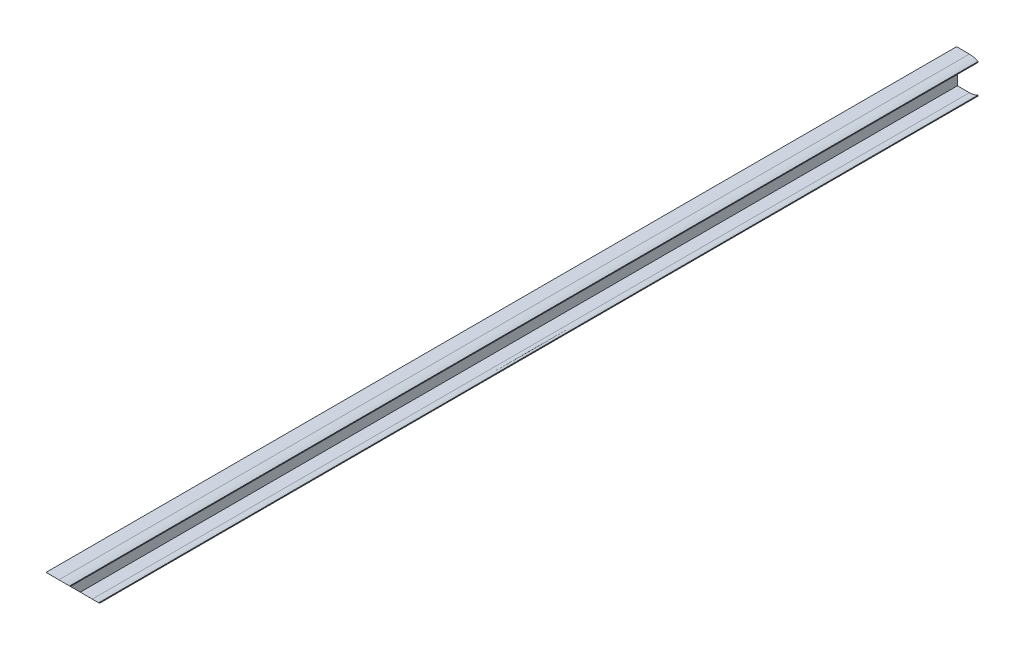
ISO-10303-21;
HEADER;
FILE_DESCRIPTION(('STEP AP214'),'2;1');
FILE_NAME('part.step','',(''),(''),'','','');
FILE_SCHEMA(('AUTOMOTIVE_DESIGN { 1 0 10303 214 1 1 1 1 }'));
ENDSEC;
DATA;
#1=APPLICATION_CONTEXT('core data for automotive mechanical design processes');
#2=APPLICATION_PROTOCOL_DEFINITION('international standard','automotive_design',2000,#1);
#3=PRODUCT_CONTEXT('',#1,'mechanical');
#4=PRODUCT('Part','Part','',(#3));
#5=PRODUCT_RELATED_PRODUCT_CATEGORY('part','',(#4));
#6=PRODUCT_DEFINITION_FORMATION('','',#4);
#7=PRODUCT_DEFINITION_CONTEXT('part definition',#1,'design');
#8=PRODUCT_DEFINITION('design','',#6,#7);
#9=PRODUCT_DEFINITION_SHAPE('','',#8);
#10=(LENGTH_UNIT() NAMED_UNIT(*) SI_UNIT(.MILLI.,.METRE.));
#11=(NAMED_UNIT(*) PLANE_ANGLE_UNIT() SI_UNIT($,.RADIAN.));
#12=(NAMED_UNIT(*) SI_UNIT($,.STERADIAN.) SOLID_ANGLE_UNIT());
#13=UNCERTAINTY_MEASURE_WITH_UNIT(LENGTH_MEASURE(1.E-05),#10,'distance_accuracy_value','');
#14=(GEOMETRIC_REPRESENTATION_CONTEXT(3) GLOBAL_UNCERTAINTY_ASSIGNED_CONTEXT((#13)) GLOBAL_UNIT_ASSIGNED_CONTEXT((#10,
#11,#12)) REPRESENTATION_CONTEXT('',''));
#15=CARTESIAN_POINT('',(0.,0.,0.));
#16=DIRECTION('',(0.,0.,1.));
#17=DIRECTION('',(1.,0.,0.));
#18=AXIS2_PLACEMENT_3D('',#15,#16,#17);
#19=CARTESIAN_POINT('',(0.,0.,2125.));
#20=DIRECTION('',(0.,1.,0.));
#21=DIRECTION('',(0.,0.,1.));
#22=AXIS2_PLACEMENT_3D('',#19,#20,#21);
#23=PLANE('',#22);
#24=DIRECTION('',(0.,0.,-1.));
#25=VECTOR('',#24,1.);
#26=CARTESIAN_POINT('',(30.,0.,2125.));
#27=LINE('',#26,#25);
#28=CARTESIAN_POINT('',(30.0000000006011,0.,2045.));
#29=VERTEX_POINT('',#28);
#30=CARTESIAN_POINT('',(30.,0.,0.));
#31=VERTEX_POINT('',#30);
#32=EDGE_CURVE('E11',#29,#31,#27,.T.);
#33=ORIENTED_EDGE('',*,*,#32,.F.);
#34=DIRECTION('',(-1.,0.,0.));
#35=VECTOR('',#34,1.);
#36=CARTESIAN_POINT('',(50.001,0.,2045.));
#37=LINE('',#36,#35);
#38=CARTESIAN_POINT('',(0.,0.,2045.));
#39=VERTEX_POINT('',#38);
#40=EDGE_CURVE('E168',#29,#39,#37,.T.);
#41=ORIENTED_EDGE('',*,*,#40,.T.);
#42=DIRECTION('',(0.,0.,-1.));
#43=VECTOR('',#42,1.);
#44=CARTESIAN_POINT('',(0.,0.,2125.));
#45=LINE('',#44,#43);
#46=CARTESIAN_POINT('',(0.,0.,0.));
#47=VERTEX_POINT('',#46);
#48=EDGE_CURVE('E116',#39,#47,#45,.T.);
#49=ORIENTED_EDGE('',*,*,#48,.T.);
#50=DIRECTION('',(1.,0.,0.));
#51=VECTOR('',#50,1.);
#52=CARTESIAN_POINT('',(0.,0.,0.));
#53=LINE('',#52,#51);
#54=EDGE_CURVE('E121',#47,#31,#53,.T.);
#55=ORIENTED_EDGE('',*,*,#54,.T.);
#56=EDGE_LOOP('',(#33,#41,#49,#55));
#57=FACE_BOUND('',#56,.T.);
#58=ADVANCED_FACE('F32',(#57),#23,.F.);
#59=CARTESIAN_POINT('',(30.,0.,2125.));
#60=CARTESIAN_POINT('',(40.6032812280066,0.0484567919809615,2125.));
#61=CARTESIAN_POINT('',(50.,5.,2125.));
#62=B_SPLINE_CURVE_WITH_KNOTS('',2,(#59,#60,#61),.UNSPECIFIED.,.F.,.F.,(3,3),(0.,1.),.UNSPECIFIED.);
#63=DIRECTION('',(0.,0.,-1.));
#64=VECTOR('',#63,1.);
#65=SURFACE_OF_LINEAR_EXTRUSION('',#62,#64);
#66=DIRECTION('',(0.,0.,-1.));
#67=VECTOR('',#66,1.);
#68=CARTESIAN_POINT('',(50.,5.,2125.));
#69=LINE('',#68,#67);
#70=CARTESIAN_POINT('',(50.,5.,2050.));
#71=VERTEX_POINT('',#70);
#72=CARTESIAN_POINT('',(50.,5.,0.));
#73=VERTEX_POINT('',#72);
#74=EDGE_CURVE('E46',#71,#73,#69,.T.);
#75=ORIENTED_EDGE('',*,*,#74,.F.);
#76=CARTESIAN_POINT('',(30.0000000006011,1.36626125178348E-12,2045.));
#77=CARTESIAN_POINT('',(30.2965221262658,0.00135208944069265,2045.00135208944));
#78=CARTESIAN_POINT('',(30.5930205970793,0.00558904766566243,2045.00558904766));
#79=CARTESIAN_POINT('',(31.1856963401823,0.0198889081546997,2045.01988890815));
#80=CARTESIAN_POINT('',(31.4818736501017,0.0299510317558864,2045.02995103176));
#81=CARTESIAN_POINT('',(32.073688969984,0.0559567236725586,2045.05595672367));
#82=CARTESIAN_POINT('',(32.3693270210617,0.0718998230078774,2045.07189982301));
#83=CARTESIAN_POINT('',(32.9597359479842,0.109694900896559,2045.1096949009));
#84=CARTESIAN_POINT('',(33.2545071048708,0.131544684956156,2045.13154468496));
#85=CARTESIAN_POINT('',(33.8430758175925,0.181175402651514,2045.18117540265));
#86=CARTESIAN_POINT('',(34.1368732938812,0.208956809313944,2045.20895680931));
#87=CARTESIAN_POINT('',(34.7232698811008,0.270449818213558,2045.27044981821));
#88=CARTESIAN_POINT('',(35.0158687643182,0.304162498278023,2045.30416249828));
#89=CARTESIAN_POINT('',(35.8889009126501,0.413848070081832,2045.41384807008));
#90=CARTESIAN_POINT('',(36.4671828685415,0.498588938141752,2045.49858893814));
#91=CARTESIAN_POINT('',(37.6162181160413,0.69114757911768,2045.69114757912));
#92=CARTESIAN_POINT('',(38.1869682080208,0.798974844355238,2045.79897484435));
#93=CARTESIAN_POINT('',(39.3191210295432,1.03701619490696,2046.03701619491));
#94=CARTESIAN_POINT('',(39.8805226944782,1.16723281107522,2046.16723281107));
#95=CARTESIAN_POINT('',(40.993487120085,1.44938335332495,2046.44938335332));
#96=CARTESIAN_POINT('',(41.5450291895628,1.60135802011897,2046.60135802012));
#97=CARTESIAN_POINT('',(42.6358830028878,1.92568946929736,2046.9256894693));
#98=CARTESIAN_POINT('',(43.1751963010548,2.09804364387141,2047.09804364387));
#99=CARTESIAN_POINT('',(44.2406108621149,2.46185600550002,2047.4618560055));
#100=CARTESIAN_POINT('',(44.7667154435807,2.65330933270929,2047.65330933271));
#101=CARTESIAN_POINT('',(45.560204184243,2.95948974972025,2047.95948974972));
#102=CARTESIAN_POINT('',(45.8325761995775,3.06781364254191,2048.06781364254));
#103=CARTESIAN_POINT('',(46.3733730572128,3.28921123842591,2048.28921123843));
#104=CARTESIAN_POINT('',(46.6417986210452,3.40228405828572,2048.40228405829));
#105=CARTESIAN_POINT('',(47.174672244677,3.63298659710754,2048.63298659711));
#106=CARTESIAN_POINT('',(47.4391205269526,3.75061605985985,2048.75061605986));
#107=CARTESIAN_POINT('',(48.4854647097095,4.22828118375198,2049.22828118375));
#108=CARTESIAN_POINT('',(49.2516390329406,4.60563986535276,2049.60563986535));
#109=CARTESIAN_POINT('',(50.,5.0000000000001,2050.));
#110=B_SPLINE_CURVE_WITH_KNOTS('',3,(#76,#77,#78,#79,#80,#81,#82,#83,#84,#85,#86,#87,#88,#89,
#90,#91,#92,#93,#94,#95,#96,#97,#98,#99,#100,#101,#102,#103,#104,#105,#106,#107,#108,#109),
.UNSPECIFIED.,.F.,.F.,(4,2,2,2,2,2,2,2,2,2,2,2,2,2,2,2,4),(0.,0.889560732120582,
1.77900258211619,2.6683735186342,3.55741448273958,4.44652637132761,5.33579999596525,
7.10646365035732,8.8778567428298,10.6494502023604,12.4244053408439,14.199133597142,
15.9734114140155,16.9108234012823,17.8480618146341,18.7852476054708,21.5842762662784),.UNSPECIFIED.);
#111=EDGE_CURVE('E158',#29,#71,#110,.T.);
#112=ORIENTED_EDGE('',*,*,#111,.F.);
#113=ORIENTED_EDGE('',*,*,#32,.T.);
#114=CARTESIAN_POINT('',(30.,0.,0.));
#115=CARTESIAN_POINT('',(40.6032812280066,0.0484567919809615,0.));
#116=CARTESIAN_POINT('',(50.,5.,0.));
#117=B_SPLINE_CURVE_WITH_KNOTS('',2,(#114,#115,#116),.UNSPECIFIED.,.F.,.F.,(3,3),(0.,1.),.UNSPECIFIED.);
#118=EDGE_CURVE('E307',#31,#73,#117,.T.);
#119=ORIENTED_EDGE('',*,*,#118,.T.);
#120=EDGE_LOOP('',(#75,#112,#113,#119));
#121=FACE_BOUND('',#120,.T.);
#122=ADVANCED_FACE('F243',(#121),#65,.F.);
#123=CARTESIAN_POINT('',(50.,5.,2125.));
#124=DIRECTION('',(-1.,0.,0.));
#125=DIRECTION('',(0.,0.,1.));
#126=AXIS2_PLACEMENT_3D('',#123,#124,#125);
#127=PLANE('',#126);
#128=DIRECTION('',(0.,0.,-1.));
#129=VECTOR('',#128,1.);
#130=CARTESIAN_POINT('',(50.,7.00000000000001,2125.));
#131=LINE('',#130,#129);
#132=CARTESIAN_POINT('',(50.,7.00000000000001,2052.));
#133=VERTEX_POINT('',#132);
#134=CARTESIAN_POINT('',(50.,7.00000000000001,0.));
#135=VERTEX_POINT('',#134);
#136=EDGE_CURVE('E155',#133,#135,#131,.T.);
#137=ORIENTED_EDGE('',*,*,#136,.F.);
#138=DIRECTION('',(0.,0.707106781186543,0.707106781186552));
#139=VECTOR('',#138,1.);
#140=CARTESIAN_POINT('',(50.,80.,2125.));
#141=LINE('',#140,#139);
#142=EDGE_CURVE('E161',#71,#133,#141,.T.);
#143=ORIENTED_EDGE('',*,*,#142,.F.);
#144=ORIENTED_EDGE('',*,*,#74,.T.);
#145=DIRECTION('',(0.,1.,0.));
#146=VECTOR('',#145,1.);
#147=CARTESIAN_POINT('',(50.,5.,0.));
#148=LINE('',#147,#146);
#149=EDGE_CURVE('E311',#73,#135,#148,.T.);
#150=ORIENTED_EDGE('',*,*,#149,.T.);
#151=EDGE_LOOP('',(#137,#143,#144,#150));
#152=FACE_BOUND('',#151,.T.);
#153=ADVANCED_FACE('F246',(#152),#127,.F.);
#154=CARTESIAN_POINT('',(50.,7.00000000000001,2125.));
#155=CARTESIAN_POINT('',(40.6032812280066,2.04845679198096,2125.));
#156=CARTESIAN_POINT('',(30.,2.,2125.));
#157=B_SPLINE_CURVE_WITH_KNOTS('',2,(#154,#155,#156),.UNSPECIFIED.,.F.,.F.,(3,3),(0.,1.),.UNSPECIFIED.);
#158=DIRECTION('',(0.,0.,-1.));
#159=VECTOR('',#158,1.);
#160=SURFACE_OF_LINEAR_EXTRUSION('',#157,#159);
#161=DIRECTION('',(0.,0.,-1.));
#162=VECTOR('',#161,1.);
#163=CARTESIAN_POINT('',(30.,2.,2125.));
#164=LINE('',#163,#162);
#165=CARTESIAN_POINT('',(30.,2.,2047.));
#166=VERTEX_POINT('',#165);
#167=CARTESIAN_POINT('',(30.,2.,0.));
#168=VERTEX_POINT('',#167);
#169=EDGE_CURVE('E144',#166,#168,#164,.T.);
#170=ORIENTED_EDGE('',*,*,#169,.F.);
#171=CARTESIAN_POINT('',(50.,7.00000000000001,2052.));
#172=CARTESIAN_POINT('',(49.521055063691,6.74761460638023,2051.74761460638));
#173=CARTESIAN_POINT('',(49.0347280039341,6.50214773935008,2051.50214773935));
#174=CARTESIAN_POINT('',(48.0467010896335,6.02606279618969,2051.02606279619));
#175=CARTESIAN_POINT('',(47.544979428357,5.79546736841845,2050.79546736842));
#176=CARTESIAN_POINT('',(46.5267291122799,5.35078644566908,2050.35078644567));
#177=CARTESIAN_POINT('',(46.0101932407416,5.13670919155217,2050.13670919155));
#178=CARTESIAN_POINT('',(44.9634416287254,4.72679072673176,2049.72679072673));
#179=CARTESIAN_POINT('',(44.4332389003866,4.53093293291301,2049.53093293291));
#180=CARTESIAN_POINT('',(43.3596325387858,4.15871016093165,2049.15871016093));
#181=CARTESIAN_POINT('',(42.8162357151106,3.98233537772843,2048.98233537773));
#182=CARTESIAN_POINT('',(41.7171702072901,3.65035131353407,2048.65035131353));
#183=CARTESIAN_POINT('',(41.1615076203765,3.49473197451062,2048.49473197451));
#184=CARTESIAN_POINT('',(40.1825845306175,3.24237137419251,2048.24237137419));
#185=CARTESIAN_POINT('',(39.7618260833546,3.14075340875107,2048.14075340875));
#186=CARTESIAN_POINT('',(38.9146879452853,2.95002496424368,2047.95002496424));
#187=CARTESIAN_POINT('',(38.4883085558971,2.86091381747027,2047.86091381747));
#188=CARTESIAN_POINT('',(37.6310401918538,2.69562554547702,2047.69562554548));
#189=CARTESIAN_POINT('',(37.2001563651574,2.61943507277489,2047.61943507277));
#190=CARTESIAN_POINT('',(36.3341748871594,2.48013219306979,2047.48013219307));
#191=CARTESIAN_POINT('',(35.8990771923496,2.41701992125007,2047.41701992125));
#192=CARTESIAN_POINT('',(35.0123765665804,2.30235066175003,2047.30235066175));
#193=CARTESIAN_POINT('',(34.5606694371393,2.25119612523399,2047.25119612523));
#194=CARTESIAN_POINT('',(33.6544975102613,2.16301119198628,2047.16301119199));
#195=CARTESIAN_POINT('',(33.2000326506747,2.12598111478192,2047.12598111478));
#196=CARTESIAN_POINT('',(32.2884626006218,2.0659644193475,2047.06596441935));
#197=CARTESIAN_POINT('',(31.831354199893,2.04300224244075,2047.04300224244));
#198=CARTESIAN_POINT('',(30.9161801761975,2.01105819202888,2047.01105819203));
#199=CARTESIAN_POINT('',(30.4581145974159,2.00207568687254,2047.00207568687));
#200=CARTESIAN_POINT('',(30.,1.99999999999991,2047.));
#201=B_SPLINE_CURVE_WITH_KNOTS('',3,(#171,#172,#173,#174,#175,#176,#177,#178,#179,#180,#181,
#182,#183,#184,#185,#186,#187,#188,#189,#190,#191,#192,#193,#194,#195,#196,#197,#198,#199,#200),
.UNSPECIFIED.,.F.,.F.,(4,2,2,2,2,2,2,2,2,2,2,2,2,2,4),(0.,1.79192712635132,3.58652177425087,
5.38200602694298,7.17583972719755,8.96876650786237,10.760821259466,12.0943329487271,
13.4277734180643,14.7598278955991,16.0918961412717,17.463838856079,18.8358126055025,
20.2101632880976,21.5844518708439),.UNSPECIFIED.);
#202=EDGE_CURVE('E380',#133,#166,#201,.T.);
#203=ORIENTED_EDGE('',*,*,#202,.F.);
#204=ORIENTED_EDGE('',*,*,#136,.T.);
#205=CARTESIAN_POINT('',(50.,7.00000000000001,0.));
#206=CARTESIAN_POINT('',(40.6032812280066,2.04845679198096,0.));
#207=CARTESIAN_POINT('',(30.,2.,0.));
#208=B_SPLINE_CURVE_WITH_KNOTS('',2,(#205,#206,#207),.UNSPECIFIED.,.F.,.F.,(3,3),(0.,1.),.UNSPECIFIED.);
#209=EDGE_CURVE('E313',#135,#168,#208,.T.);
#210=ORIENTED_EDGE('',*,*,#209,.T.);
#211=EDGE_LOOP('',(#170,#203,#204,#210));
#212=FACE_BOUND('',#211,.T.);
#213=ADVANCED_FACE('F250',(#212),#160,.F.);
#214=CARTESIAN_POINT('',(2.,2.,2125.));
#215=DIRECTION('',(0.,-1.,0.));
#216=DIRECTION('',(0.,0.,-1.));
#217=AXIS2_PLACEMENT_3D('',#214,#215,#216);
#218=PLANE('',#217);
#219=DIRECTION('',(0.,0.,-1.));
#220=VECTOR('',#219,1.);
#221=CARTESIAN_POINT('',(2.,2.,2125.));
#222=LINE('',#221,#220);
#223=CARTESIAN_POINT('',(2.,2.,2047.));
#224=VERTEX_POINT('',#223);
#225=CARTESIAN_POINT('',(2.,2.,0.));
#226=VERTEX_POINT('',#225);
#227=EDGE_CURVE('E150',#224,#226,#222,.T.);
#228=ORIENTED_EDGE('',*,*,#227,.F.);
#229=DIRECTION('',(-1.,0.,0.));
#230=VECTOR('',#229,1.);
#231=CARTESIAN_POINT('',(50.001,2.,2047.));
#232=LINE('',#231,#230);
#233=EDGE_CURVE('E231',#166,#224,#232,.T.);
#234=ORIENTED_EDGE('',*,*,#233,.F.);
#235=ORIENTED_EDGE('',*,*,#169,.T.);
#236=DIRECTION('',(-1.,0.,0.));
#237=VECTOR('',#236,1.);
#238=CARTESIAN_POINT('',(2.,2.,0.));
#239=LINE('',#238,#237);
#240=EDGE_CURVE('E325',#168,#226,#239,.T.);
#241=ORIENTED_EDGE('',*,*,#240,.T.);
#242=EDGE_LOOP('',(#228,#234,#235,#241));
#243=FACE_BOUND('',#242,.T.);
#244=ADVANCED_FACE('F254',(#243),#218,.F.);
#245=CARTESIAN_POINT('',(2.,78.,2125.));
#246=DIRECTION('',(-1.,0.,0.));
#247=DIRECTION('',(0.,0.,1.));
#248=AXIS2_PLACEMENT_3D('',#245,#246,#247);
#249=PLANE('',#248);
#250=DIRECTION('',(0.,0.,-1.));
#251=VECTOR('',#250,1.);
#252=CARTESIAN_POINT('',(2.,78.,2125.));
#253=LINE('',#252,#251);
#254=CARTESIAN_POINT('',(2.,78.,2123.));
#255=VERTEX_POINT('',#254);
#256=CARTESIAN_POINT('',(2.,78.,0.));
#257=VERTEX_POINT('',#256);
#258=EDGE_CURVE('E143',#255,#257,#253,.T.);
#259=ORIENTED_EDGE('',*,*,#258,.F.);
#260=DIRECTION('',(0.,0.707106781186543,0.707106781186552));
#261=VECTOR('',#260,1.);
#262=CARTESIAN_POINT('',(2.,80.,2125.));
#263=LINE('',#262,#261);
#264=EDGE_CURVE('E217',#224,#255,#263,.T.);
#265=ORIENTED_EDGE('',*,*,#264,.F.);
#266=ORIENTED_EDGE('',*,*,#227,.T.);
#267=DIRECTION('',(0.,1.,0.));
#268=VECTOR('',#267,1.);
#269=CARTESIAN_POINT('',(2.,78.,0.));
#270=LINE('',#269,#268);
#271=EDGE_CURVE('E331',#226,#257,#270,.T.);
#272=ORIENTED_EDGE('',*,*,#271,.T.);
#273=EDGE_LOOP('',(#259,#265,#266,#272));
#274=FACE_BOUND('',#273,.T.);
#275=ADVANCED_FACE('F258',(#274),#249,.F.);
#276=CARTESIAN_POINT('',(2.,78.,2125.));
#277=DIRECTION('',(0.,1.,0.));
#278=DIRECTION('',(0.,0.,1.));
#279=AXIS2_PLACEMENT_3D('',#276,#277,#278);
#280=PLANE('',#279);
#281=DIRECTION('',(0.,0.,-1.));
#282=VECTOR('',#281,1.);
#283=CARTESIAN_POINT('',(30.,78.,2125.));
#284=LINE('',#283,#282);
#285=CARTESIAN_POINT('',(30.,78.,2123.));
#286=VERTEX_POINT('',#285);
#287=CARTESIAN_POINT('',(30.,78.,0.));
#288=VERTEX_POINT('',#287);
#289=EDGE_CURVE('E141',#286,#288,#284,.T.);
#290=ORIENTED_EDGE('',*,*,#289,.F.);
#291=DIRECTION('',(1.,0.,0.));
#292=VECTOR('',#291,1.);
#293=CARTESIAN_POINT('',(50.001,78.,2123.));
#294=LINE('',#293,#292);
#295=EDGE_CURVE('E214',#255,#286,#294,.T.);
#296=ORIENTED_EDGE('',*,*,#295,.F.);
#297=ORIENTED_EDGE('',*,*,#258,.T.);
#298=DIRECTION('',(1.,0.,0.));
#299=VECTOR('',#298,1.);
#300=CARTESIAN_POINT('',(2.,78.,0.));
#301=LINE('',#300,#299);
#302=EDGE_CURVE('E334',#257,#288,#301,.T.);
#303=ORIENTED_EDGE('',*,*,#302,.T.);
#304=EDGE_LOOP('',(#290,#296,#297,#303));
#305=FACE_BOUND('',#304,.T.);
#306=ADVANCED_FACE('F262',(#305),#280,.F.);
#307=CARTESIAN_POINT('',(30.,78.,2125.));
#308=CARTESIAN_POINT('',(40.6032812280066,77.951543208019,2125.));
#309=CARTESIAN_POINT('',(50.,73.,2125.));
#310=B_SPLINE_CURVE_WITH_KNOTS('',2,(#307,#308,#309),.UNSPECIFIED.,.F.,.F.,(3,3),(0.,1.),.UNSPECIFIED.);
#311=DIRECTION('',(0.,0.,-1.));
#312=VECTOR('',#311,1.);
#313=SURFACE_OF_LINEAR_EXTRUSION('',#310,#312);
#314=DIRECTION('',(0.,0.,-1.));
#315=VECTOR('',#314,1.);
#316=CARTESIAN_POINT('',(50.,73.,2125.));
#317=LINE('',#316,#315);
#318=CARTESIAN_POINT('',(50.,73.,2118.));
#319=VERTEX_POINT('',#318);
#320=CARTESIAN_POINT('',(50.,73.,0.));
#321=VERTEX_POINT('',#320);
#322=EDGE_CURVE('E137',#319,#321,#317,.T.);
#323=ORIENTED_EDGE('',*,*,#322,.F.);
#324=CARTESIAN_POINT('',(30.,78.,2123.));
#325=CARTESIAN_POINT('',(30.2965221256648,77.9986479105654,2122.99864791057));
#326=CARTESIAN_POINT('',(30.5930205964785,77.9944109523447,2122.99441095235));
#327=CARTESIAN_POINT('',(31.1856963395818,77.9801110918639,2122.98011109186));
#328=CARTESIAN_POINT('',(31.4818736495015,77.9700489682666,2122.97004896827));
#329=CARTESIAN_POINT('',(32.0736889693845,77.9440432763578,2122.94404327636));
#330=CARTESIAN_POINT('',(32.3693270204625,77.9281001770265,2122.92810017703));
#331=CARTESIAN_POINT('',(32.959735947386,77.8903050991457,2122.89030509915));
#332=CARTESIAN_POINT('',(33.2545071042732,77.8684553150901,2122.86845531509));
#333=CARTESIAN_POINT('',(33.8430758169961,77.8188245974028,2122.8188245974));
#334=CARTESIAN_POINT('',(34.1368732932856,77.7910431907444,2122.79104319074));
#335=CARTESIAN_POINT('',(34.7232698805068,77.7295501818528,2122.72955018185));
#336=CARTESIAN_POINT('',(35.0158687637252,77.6958375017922,2122.69583750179));
#337=CARTESIAN_POINT('',(35.8889009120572,77.5861519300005,2122.58615193));
#338=CARTESIAN_POINT('',(36.467182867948,77.5014110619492,2122.50141106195));
#339=CARTESIAN_POINT('',(37.6162181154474,77.3088524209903,2122.30885242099));
#340=CARTESIAN_POINT('',(38.186968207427,77.2010251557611,2122.20102515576));
#341=CARTESIAN_POINT('',(39.3191210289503,76.9629838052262,2121.96298380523));
#342=CARTESIAN_POINT('',(39.8805226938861,76.8327671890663,2121.83276718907));
#343=CARTESIAN_POINT('',(40.9934871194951,76.5506166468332,2121.55061664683));
#344=CARTESIAN_POINT('',(41.5450291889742,76.3986419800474,2121.39864198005));
#345=CARTESIAN_POINT('',(42.6358830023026,76.0743105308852,2121.07431053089));
#346=CARTESIAN_POINT('',(43.1751963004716,75.9019563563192,2120.90195635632));
#347=CARTESIAN_POINT('',(44.2406108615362,75.5381439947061,2120.53814399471));
#348=CARTESIAN_POINT('',(44.7667154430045,75.3466906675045,2120.3466906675));
#349=CARTESIAN_POINT('',(45.5602041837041,75.0405102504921,2120.04051025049));
#350=CARTESIAN_POINT('',(45.8325761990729,74.932186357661,2119.93218635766));
#351=CARTESIAN_POINT('',(46.3733730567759,74.7107887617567,2119.71078876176));
#352=CARTESIAN_POINT('',(46.6417986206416,74.5977159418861,2119.59771594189));
#353=CARTESIAN_POINT('',(47.1746722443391,74.3670134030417,2119.36701340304));
#354=CARTESIAN_POINT('',(47.4391205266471,74.2493839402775,2119.24938394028));
#355=CARTESIAN_POINT('',(48.4854647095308,73.771718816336,2118.77171881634));
#356=CARTESIAN_POINT('',(49.2516390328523,73.3943601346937,2118.39436013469));
#357=CARTESIAN_POINT('',(50.,73.,2118.));
#358=B_SPLINE_CURVE_WITH_KNOTS('',3,(#324,#325,#326,#327,#328,#329,#330,#331,#332,#333,#334,
#335,#336,#337,#338,#339,#340,#341,#342,#343,#344,#345,#346,#347,#348,#349,#350,#351,#352,#353,
#354,#355,#356,#357),.UNSPECIFIED.,.F.,.F.,(4,2,2,2,2,2,2,2,2,2,2,2,2,2,2,2,4),(0.,
0.889560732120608,1.77900258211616,2.66837351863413,3.55741448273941,4.44652637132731,
5.33579999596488,7.10646365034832,8.87785674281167,10.6494502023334,12.4244053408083,
14.1991335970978,15.9734114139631,16.9108234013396,17.8480618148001,18.7852476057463,
21.5842762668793),.UNSPECIFIED.);
#359=EDGE_CURVE('E212',#286,#319,#358,.T.);
#360=ORIENTED_EDGE('',*,*,#359,.F.);
#361=ORIENTED_EDGE('',*,*,#289,.T.);
#362=CARTESIAN_POINT('',(30.,78.,0.));
#363=CARTESIAN_POINT('',(40.6032812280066,77.951543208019,0.));
#364=CARTESIAN_POINT('',(50.,73.,0.));
#365=B_SPLINE_CURVE_WITH_KNOTS('',2,(#362,#363,#364),.UNSPECIFIED.,.F.,.F.,(3,3),(0.,1.),.UNSPECIFIED.);
#366=EDGE_CURVE('E337',#288,#321,#365,.T.);
#367=ORIENTED_EDGE('',*,*,#366,.T.);
#368=EDGE_LOOP('',(#323,#360,#361,#367));
#369=FACE_BOUND('',#368,.T.);
#370=ADVANCED_FACE('F266',(#369),#313,.F.);
#371=CARTESIAN_POINT('',(50.,75.,2125.));
#372=DIRECTION('',(-1.,0.,0.));
#373=DIRECTION('',(0.,0.,1.));
#374=AXIS2_PLACEMENT_3D('',#371,#372,#373);
#375=PLANE('',#374);
#376=DIRECTION('',(0.,0.,-1.));
#377=VECTOR('',#376,1.);
#378=CARTESIAN_POINT('',(50.,75.,2125.));
#379=LINE('',#378,#377);
#380=CARTESIAN_POINT('',(50.,75.,2120.));
#381=VERTEX_POINT('',#380);
#382=CARTESIAN_POINT('',(50.,75.,0.));
#383=VERTEX_POINT('',#382);
#384=EDGE_CURVE('E129',#381,#383,#379,.T.);
#385=ORIENTED_EDGE('',*,*,#384,.F.);
#386=DIRECTION('',(0.,0.707106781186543,0.707106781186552));
#387=VECTOR('',#386,1.);
#388=CARTESIAN_POINT('',(50.,80.,2125.));
#389=LINE('',#388,#387);
#390=EDGE_CURVE('E220',#319,#381,#389,.T.);
#391=ORIENTED_EDGE('',*,*,#390,.F.);
#392=ORIENTED_EDGE('',*,*,#322,.T.);
#393=DIRECTION('',(0.,1.,0.));
#394=VECTOR('',#393,1.);
#395=CARTESIAN_POINT('',(50.,75.,0.));
#396=LINE('',#395,#394);
#397=EDGE_CURVE('E342',#321,#383,#396,.T.);
#398=ORIENTED_EDGE('',*,*,#397,.T.);
#399=EDGE_LOOP('',(#385,#391,#392,#398));
#400=FACE_BOUND('',#399,.T.);
#401=ADVANCED_FACE('F270',(#400),#375,.F.);
#402=CARTESIAN_POINT('',(50.,75.,2125.));
#403=CARTESIAN_POINT('',(40.6032812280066,79.951543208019,2125.));
#404=CARTESIAN_POINT('',(30.,80.,2125.));
#405=B_SPLINE_CURVE_WITH_KNOTS('',2,(#402,#403,#404),.UNSPECIFIED.,.F.,.F.,(3,3),(0.,1.),.UNSPECIFIED.);
#406=DIRECTION('',(0.,0.,-1.));
#407=VECTOR('',#406,1.);
#408=SURFACE_OF_LINEAR_EXTRUSION('',#405,#407);
#409=DIRECTION('',(0.,0.,-1.));
#410=VECTOR('',#409,1.);
#411=CARTESIAN_POINT('',(30.,80.,2125.));
#412=LINE('',#411,#410);
#413=CARTESIAN_POINT('',(30.,80.,2125.));
#414=VERTEX_POINT('',#413);
#415=CARTESIAN_POINT('',(30.,80.,0.));
#416=VERTEX_POINT('',#415);
#417=EDGE_CURVE('E101',#414,#416,#412,.T.);
#418=ORIENTED_EDGE('',*,*,#417,.F.);
#419=CARTESIAN_POINT('',(50.,75.,2120.));
#420=CARTESIAN_POINT('',(49.5210550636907,75.2523853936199,2120.25238539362));
#421=CARTESIAN_POINT('',(49.0347280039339,75.49785226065,2120.49785226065));
#422=CARTESIAN_POINT('',(48.0467010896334,75.9739372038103,2120.97393720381));
#423=CARTESIAN_POINT('',(47.5449794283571,76.2045326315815,2121.20453263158));
#424=CARTESIAN_POINT('',(46.5267291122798,76.6492135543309,2121.64921355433));
#425=CARTESIAN_POINT('',(46.0101932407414,76.8632908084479,2121.86329080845));
#426=CARTESIAN_POINT('',(44.9634416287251,77.2732092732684,2122.27320927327));
#427=CARTESIAN_POINT('',(44.4332389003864,77.4690670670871,2122.46906706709));
#428=CARTESIAN_POINT('',(43.3596325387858,77.8412898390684,2122.84128983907));
#429=CARTESIAN_POINT('',(42.8162357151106,78.0176646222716,2123.01766462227));
#430=CARTESIAN_POINT('',(41.71717020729,78.3496486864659,2123.34964868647));
#431=CARTESIAN_POINT('',(41.1615076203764,78.5052680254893,2123.50526802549));
#432=CARTESIAN_POINT('',(40.1825845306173,78.7576286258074,2123.75762862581));
#433=CARTESIAN_POINT('',(39.7618260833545,78.8592465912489,2123.85924659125));
#434=CARTESIAN_POINT('',(38.9146879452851,79.0499750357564,2124.04997503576));
#435=CARTESIAN_POINT('',(38.488308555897,79.1390861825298,2124.13908618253));
#436=CARTESIAN_POINT('',(37.6310401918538,79.304374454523,2124.30437445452));
#437=CARTESIAN_POINT('',(37.2001563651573,79.3805649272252,2124.38056492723));
#438=CARTESIAN_POINT('',(36.3341748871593,79.5198678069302,2124.51986780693));
#439=CARTESIAN_POINT('',(35.8990771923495,79.5829800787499,2124.58298007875));
#440=CARTESIAN_POINT('',(35.0123765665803,79.6976493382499,2124.69764933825));
#441=CARTESIAN_POINT('',(34.5606694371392,79.748803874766,2124.74880387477));
#442=CARTESIAN_POINT('',(33.6544975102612,79.8369888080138,2124.83698880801));
#443=CARTESIAN_POINT('',(33.2000326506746,79.8740188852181,2124.87401888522));
#444=CARTESIAN_POINT('',(32.2884626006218,79.9340355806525,2124.93403558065));
#445=CARTESIAN_POINT('',(31.831354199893,79.9569977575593,2124.95699775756));
#446=CARTESIAN_POINT('',(30.9161801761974,79.9889418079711,2124.98894180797));
#447=CARTESIAN_POINT('',(30.4581145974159,79.9979243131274,2124.99792431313));
#448=CARTESIAN_POINT('',(30.,80.,2125.));
#449=B_SPLINE_CURVE_WITH_KNOTS('',3,(#419,#420,#421,#422,#423,#424,#425,#426,#427,#428,#429,
#430,#431,#432,#433,#434,#435,#436,#437,#438,#439,#440,#441,#442,#443,#444,#445,#446,#447,#448),
.UNSPECIFIED.,.F.,.F.,(4,2,2,2,2,2,2,2,2,2,2,2,2,2,4),(0.,1.79192712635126,3.58652177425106,
5.38200602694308,7.17583972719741,8.96876650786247,10.760821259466,12.0943329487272,
13.4277734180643,14.7598278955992,16.0918961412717,17.463838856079,18.8358126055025,
20.2101632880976,21.5844518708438),.UNSPECIFIED.);
#450=EDGE_CURVE('E54',#381,#414,#449,.T.);
#451=ORIENTED_EDGE('',*,*,#450,.F.);
#452=ORIENTED_EDGE('',*,*,#384,.T.);
#453=CARTESIAN_POINT('',(50.,75.,0.));
#454=CARTESIAN_POINT('',(40.6032812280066,79.951543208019,0.));
#455=CARTESIAN_POINT('',(30.,80.,0.));
#456=B_SPLINE_CURVE_WITH_KNOTS('',2,(#453,#454,#455),.UNSPECIFIED.,.F.,.F.,(3,3),(0.,1.),.UNSPECIFIED.);
#457=EDGE_CURVE('E106',#383,#416,#456,.T.);
#458=ORIENTED_EDGE('',*,*,#457,.T.);
#459=EDGE_LOOP('',(#418,#451,#452,#458));
#460=FACE_BOUND('',#459,.T.);
#461=ADVANCED_FACE('F287',(#460),#408,.F.);
#462=CARTESIAN_POINT('',(0.,80.,2125.));
#463=DIRECTION('',(0.,-1.,0.));
#464=DIRECTION('',(0.,0.,-1.));
#465=AXIS2_PLACEMENT_3D('',#462,#463,#464);
#466=PLANE('',#465);
#467=DIRECTION('',(-1.,0.,0.));
#468=VECTOR('',#467,1.);
#469=CARTESIAN_POINT('',(0.,80.,0.));
#470=LINE('',#469,#468);
#471=CARTESIAN_POINT('',(0.,80.,0.));
#472=VERTEX_POINT('',#471);
#473=EDGE_CURVE('E95',#416,#472,#470,.T.);
#474=ORIENTED_EDGE('',*,*,#473,.T.);
#475=DIRECTION('',(0.,0.,-1.));
#476=VECTOR('',#475,1.);
#477=CARTESIAN_POINT('',(0.,80.,2125.));
#478=LINE('',#477,#476);
#479=CARTESIAN_POINT('',(0.,80.,2125.));
#480=VERTEX_POINT('',#479);
#481=EDGE_CURVE('E100',#480,#472,#478,.T.);
#482=ORIENTED_EDGE('',*,*,#481,.F.);
#483=DIRECTION('',(-1.,0.,0.));
#484=VECTOR('',#483,1.);
#485=CARTESIAN_POINT('',(0.,80.,2125.));
#486=LINE('',#485,#484);
#487=EDGE_CURVE('E122',#414,#480,#486,.T.);
#488=ORIENTED_EDGE('',*,*,#487,.F.);
#489=ORIENTED_EDGE('',*,*,#417,.T.);
#490=EDGE_LOOP('',(#474,#482,#488,#489));
#491=FACE_BOUND('',#490,.T.);
#492=ADVANCED_FACE('F97',(#491),#466,.F.);
#493=CARTESIAN_POINT('',(0.,0.,2125.));
#494=DIRECTION('',(1.,0.,0.));
#495=DIRECTION('',(0.,0.,-1.));
#496=AXIS2_PLACEMENT_3D('',#493,#494,#495);
#497=PLANE('',#496);
#498=ORIENTED_EDGE('',*,*,#48,.F.);
#499=DIRECTION('',(0.,-0.707106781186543,-0.707106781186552));
#500=VECTOR('',#499,1.);
#501=CARTESIAN_POINT('',(0.,80.,2125.));
#502=LINE('',#501,#500);
#503=EDGE_CURVE('E115',#480,#39,#502,.T.);
#504=ORIENTED_EDGE('',*,*,#503,.F.);
#505=ORIENTED_EDGE('',*,*,#481,.T.);
#506=DIRECTION('',(0.,-1.,0.));
#507=VECTOR('',#506,1.);
#508=CARTESIAN_POINT('',(0.,0.,0.));
#509=LINE('',#508,#507);
#510=EDGE_CURVE('E105',#472,#47,#509,.T.);
#511=ORIENTED_EDGE('',*,*,#510,.T.);
#512=EDGE_LOOP('',(#498,#504,#505,#511));
#513=FACE_BOUND('',#512,.T.);
#514=ADVANCED_FACE('F112',(#513),#497,.F.);
#515=CARTESIAN_POINT('',(40.3016406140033,1.27422839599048,0.));
#516=DIRECTION('',(0.,0.,-1.));
#517=DIRECTION('',(-1.,0.,0.));
#518=AXIS2_PLACEMENT_3D('',#515,#516,#517);
#519=PLANE('',#518);
#520=ORIENTED_EDGE('',*,*,#54,.F.);
#521=ORIENTED_EDGE('',*,*,#510,.F.);
#522=ORIENTED_EDGE('',*,*,#473,.F.);
#523=ORIENTED_EDGE('',*,*,#457,.F.);
#524=ORIENTED_EDGE('',*,*,#397,.F.);
#525=ORIENTED_EDGE('',*,*,#366,.F.);
#526=ORIENTED_EDGE('',*,*,#302,.F.);
#527=ORIENTED_EDGE('',*,*,#271,.F.);
#528=ORIENTED_EDGE('',*,*,#240,.F.);
#529=ORIENTED_EDGE('',*,*,#209,.F.);
#530=ORIENTED_EDGE('',*,*,#149,.F.);
#531=ORIENTED_EDGE('',*,*,#118,.F.);
#532=EDGE_LOOP('',(#520,#521,#522,#523,#524,#525,#526,#527,#528,#529,#530,#531));
#533=FACE_BOUND('',#532,.T.);
#534=ADVANCED_FACE('F118',(#533),#519,.T.);
#535=CARTESIAN_POINT('',(50.001,80.,2125.));
#536=DIRECTION('',(0.,0.707106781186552,-0.707106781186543));
#537=DIRECTION('',(0.,0.707106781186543,0.707106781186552));
#538=AXIS2_PLACEMENT_3D('',#535,#536,#537);
#539=PLANE('',#538);
#540=ORIENTED_EDGE('',*,*,#111,.T.);
#541=ORIENTED_EDGE('',*,*,#142,.T.);
#542=ORIENTED_EDGE('',*,*,#202,.T.);
#543=ORIENTED_EDGE('',*,*,#233,.T.);
#544=ORIENTED_EDGE('',*,*,#264,.T.);
#545=ORIENTED_EDGE('',*,*,#295,.T.);
#546=ORIENTED_EDGE('',*,*,#359,.T.);
#547=ORIENTED_EDGE('',*,*,#390,.T.);
#548=ORIENTED_EDGE('',*,*,#450,.T.);
#549=ORIENTED_EDGE('',*,*,#487,.T.);
#550=ORIENTED_EDGE('',*,*,#503,.T.);
#551=ORIENTED_EDGE('',*,*,#40,.F.);
#552=EDGE_LOOP('',(#540,#541,#542,#543,#544,#545,#546,#547,#548,#549,#550,#551));
#553=FACE_BOUND('',#552,.T.);
#554=ADVANCED_FACE('F170',(#553),#539,.F.);
#555=CLOSED_SHELL('',(#58,#122,#153,#213,#244,#275,#306,#370,#401,#461,#492,#514,#534,#554));
#556=MANIFOLD_SOLID_BREP('B2',#555);
#557=ADVANCED_BREP_SHAPE_REPRESENTATION('',(#18,#556),#14);
#558=SHAPE_DEFINITION_REPRESENTATION(#9,#557);
ENDSEC;
END-ISO-10303-21;
